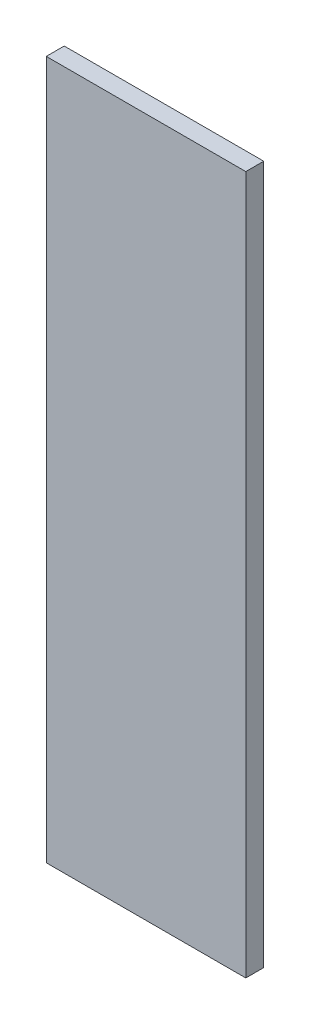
from build123d import *

# Parameters (mm, degrees)
SKETCH1_W           = 200
SKETCH1_H           = 700
BOSS_EXTRUDE1_DEPTH = 18


with BuildPart() as part:
    # Sketch1 → Boss-Extrude1 (new body)
    with BuildSketch(Plane.XY):
        Rectangle(SKETCH1_W, SKETCH1_H)
    extrude(amount=BOSS_EXTRUDE1_DEPTH)


solid = part.part
